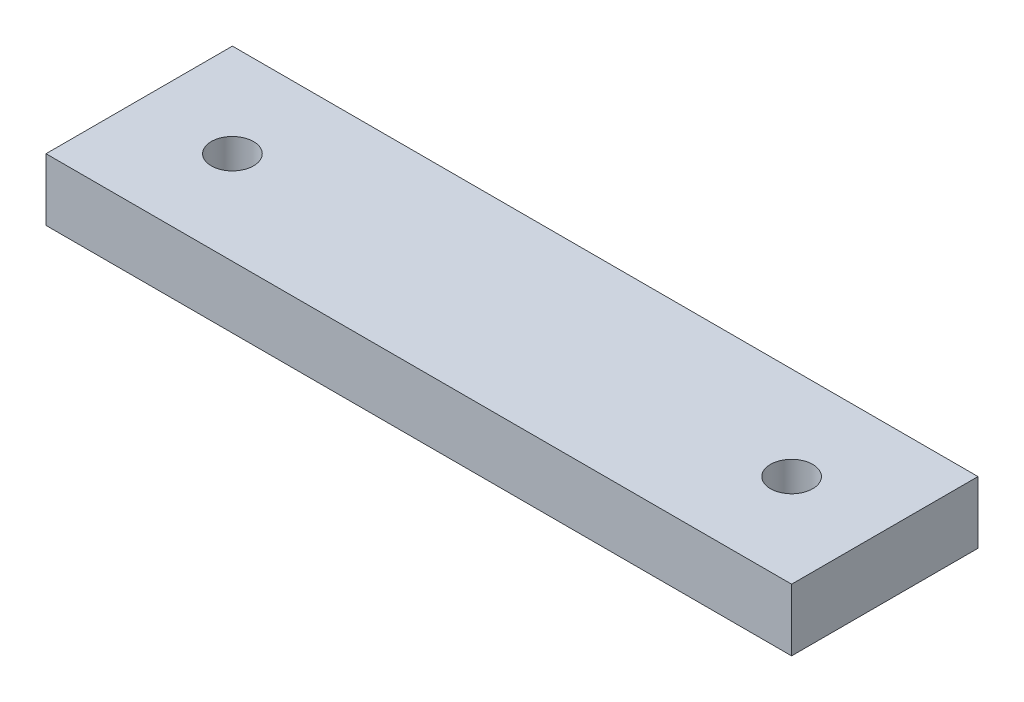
ISO-10303-21;
HEADER;
FILE_DESCRIPTION(('STEP AP214'),'2;1');
FILE_NAME('part.step','',(''),(''),'','','');
FILE_SCHEMA(('AUTOMOTIVE_DESIGN { 1 0 10303 214 1 1 1 1 }'));
ENDSEC;
DATA;
#1=APPLICATION_CONTEXT('core data for automotive mechanical design processes');
#2=APPLICATION_PROTOCOL_DEFINITION('international standard','automotive_design',2000,#1);
#3=PRODUCT_CONTEXT('',#1,'mechanical');
#4=PRODUCT('Part','Part','',(#3));
#5=PRODUCT_RELATED_PRODUCT_CATEGORY('part','',(#4));
#6=PRODUCT_DEFINITION_FORMATION('','',#4);
#7=PRODUCT_DEFINITION_CONTEXT('part definition',#1,'design');
#8=PRODUCT_DEFINITION('design','',#6,#7);
#9=PRODUCT_DEFINITION_SHAPE('','',#8);
#10=(LENGTH_UNIT() NAMED_UNIT(*) SI_UNIT(.MILLI.,.METRE.));
#11=(NAMED_UNIT(*) PLANE_ANGLE_UNIT() SI_UNIT($,.RADIAN.));
#12=(NAMED_UNIT(*) SI_UNIT($,.STERADIAN.) SOLID_ANGLE_UNIT());
#13=UNCERTAINTY_MEASURE_WITH_UNIT(LENGTH_MEASURE(1.E-05),#10,'distance_accuracy_value','');
#14=(GEOMETRIC_REPRESENTATION_CONTEXT(3) GLOBAL_UNCERTAINTY_ASSIGNED_CONTEXT((#13)) GLOBAL_UNIT_ASSIGNED_CONTEXT((#10,
#11,#12)) REPRESENTATION_CONTEXT('',''));
#15=CARTESIAN_POINT('',(0.,0.,0.));
#16=DIRECTION('',(0.,0.,1.));
#17=DIRECTION('',(1.,0.,0.));
#18=AXIS2_PLACEMENT_3D('',#15,#16,#17);
#19=CARTESIAN_POINT('',(-60.,10.,15.));
#20=DIRECTION('',(1.,0.,0.));
#21=DIRECTION('',(0.,0.,-1.));
#22=AXIS2_PLACEMENT_3D('',#19,#20,#21);
#23=PLANE('',#22);
#24=DIRECTION('',(0.,0.,1.));
#25=VECTOR('',#24,1.);
#26=CARTESIAN_POINT('',(-60.,0.,15.));
#27=LINE('',#26,#25);
#28=CARTESIAN_POINT('',(-60.,0.,-15.));
#29=VERTEX_POINT('',#28);
#30=CARTESIAN_POINT('',(-60.,0.,15.));
#31=VERTEX_POINT('',#30);
#32=EDGE_CURVE('E95',#29,#31,#27,.T.);
#33=ORIENTED_EDGE('',*,*,#32,.T.);
#34=DIRECTION('',(0.,-1.,0.));
#35=VECTOR('',#34,1.);
#36=CARTESIAN_POINT('',(-60.,10.,15.));
#37=LINE('',#36,#35);
#38=CARTESIAN_POINT('',(-60.,10.,15.));
#39=VERTEX_POINT('',#38);
#40=EDGE_CURVE('E11',#39,#31,#37,.T.);
#41=ORIENTED_EDGE('',*,*,#40,.F.);
#42=DIRECTION('',(0.,0.,1.));
#43=VECTOR('',#42,1.);
#44=CARTESIAN_POINT('',(-60.,10.,15.));
#45=LINE('',#44,#43);
#46=CARTESIAN_POINT('',(-60.,10.,-15.));
#47=VERTEX_POINT('',#46);
#48=EDGE_CURVE('E83',#47,#39,#45,.T.);
#49=ORIENTED_EDGE('',*,*,#48,.F.);
#50=DIRECTION('',(0.,-1.,0.));
#51=VECTOR('',#50,1.);
#52=CARTESIAN_POINT('',(-60.,10.,-15.));
#53=LINE('',#52,#51);
#54=EDGE_CURVE('E91',#47,#29,#53,.T.);
#55=ORIENTED_EDGE('',*,*,#54,.T.);
#56=EDGE_LOOP('',(#33,#41,#49,#55));
#57=FACE_BOUND('',#56,.T.);
#58=ADVANCED_FACE('F32',(#57),#23,.F.);
#59=CARTESIAN_POINT('',(-60.,10.,15.));
#60=DIRECTION('',(0.,0.,-1.));
#61=DIRECTION('',(-1.,0.,0.));
#62=AXIS2_PLACEMENT_3D('',#59,#60,#61);
#63=PLANE('',#62);
#64=DIRECTION('',(1.,0.,0.));
#65=VECTOR('',#64,1.);
#66=CARTESIAN_POINT('',(-60.,0.,15.));
#67=LINE('',#66,#65);
#68=CARTESIAN_POINT('',(60.,0.,15.));
#69=VERTEX_POINT('',#68);
#70=EDGE_CURVE('E87',#31,#69,#67,.T.);
#71=ORIENTED_EDGE('',*,*,#70,.T.);
#72=DIRECTION('',(0.,-1.,0.));
#73=VECTOR('',#72,1.);
#74=CARTESIAN_POINT('',(60.,10.,15.));
#75=LINE('',#74,#73);
#76=CARTESIAN_POINT('',(60.,10.,15.));
#77=VERTEX_POINT('',#76);
#78=EDGE_CURVE('E40',#77,#69,#75,.T.);
#79=ORIENTED_EDGE('',*,*,#78,.F.);
#80=DIRECTION('',(1.,0.,0.));
#81=VECTOR('',#80,1.);
#82=CARTESIAN_POINT('',(-60.,10.,15.));
#83=LINE('',#82,#81);
#84=EDGE_CURVE('E78',#39,#77,#83,.T.);
#85=ORIENTED_EDGE('',*,*,#84,.F.);
#86=ORIENTED_EDGE('',*,*,#40,.T.);
#87=EDGE_LOOP('',(#71,#79,#85,#86));
#88=FACE_BOUND('',#87,.T.);
#89=ADVANCED_FACE('F86',(#88),#63,.F.);
#90=CARTESIAN_POINT('',(60.,10.,15.));
#91=DIRECTION('',(-1.,0.,0.));
#92=DIRECTION('',(0.,0.,1.));
#93=AXIS2_PLACEMENT_3D('',#90,#91,#92);
#94=PLANE('',#93);
#95=DIRECTION('',(0.,0.,-1.));
#96=VECTOR('',#95,1.);
#97=CARTESIAN_POINT('',(60.,0.,15.));
#98=LINE('',#97,#96);
#99=CARTESIAN_POINT('',(60.,0.,-15.));
#100=VERTEX_POINT('',#99);
#101=EDGE_CURVE('E65',#69,#100,#98,.T.);
#102=ORIENTED_EDGE('',*,*,#101,.T.);
#103=DIRECTION('',(0.,-1.,0.));
#104=VECTOR('',#103,1.);
#105=CARTESIAN_POINT('',(60.,10.,-15.));
#106=LINE('',#105,#104);
#107=CARTESIAN_POINT('',(60.,10.,-15.));
#108=VERTEX_POINT('',#107);
#109=EDGE_CURVE('E88',#108,#100,#106,.T.);
#110=ORIENTED_EDGE('',*,*,#109,.F.);
#111=DIRECTION('',(0.,0.,-1.));
#112=VECTOR('',#111,1.);
#113=CARTESIAN_POINT('',(60.,10.,15.));
#114=LINE('',#113,#112);
#115=EDGE_CURVE('E81',#77,#108,#114,.T.);
#116=ORIENTED_EDGE('',*,*,#115,.F.);
#117=ORIENTED_EDGE('',*,*,#78,.T.);
#118=EDGE_LOOP('',(#102,#110,#116,#117));
#119=FACE_BOUND('',#118,.T.);
#120=ADVANCED_FACE('F89',(#119),#94,.F.);
#121=CARTESIAN_POINT('',(-60.,10.,-15.));
#122=DIRECTION('',(0.,0.,1.));
#123=DIRECTION('',(1.,0.,0.));
#124=AXIS2_PLACEMENT_3D('',#121,#122,#123);
#125=PLANE('',#124);
#126=DIRECTION('',(-1.,0.,0.));
#127=VECTOR('',#126,1.);
#128=CARTESIAN_POINT('',(-60.,0.,-15.));
#129=LINE('',#128,#127);
#130=EDGE_CURVE('E71',#100,#29,#129,.T.);
#131=ORIENTED_EDGE('',*,*,#130,.T.);
#132=ORIENTED_EDGE('',*,*,#54,.F.);
#133=DIRECTION('',(-1.,0.,0.));
#134=VECTOR('',#133,1.);
#135=CARTESIAN_POINT('',(-60.,10.,-15.));
#136=LINE('',#135,#134);
#137=EDGE_CURVE('E48',#108,#47,#136,.T.);
#138=ORIENTED_EDGE('',*,*,#137,.F.);
#139=ORIENTED_EDGE('',*,*,#109,.T.);
#140=EDGE_LOOP('',(#131,#132,#138,#139));
#141=FACE_BOUND('',#140,.T.);
#142=ADVANCED_FACE('F103',(#141),#125,.F.);
#143=CARTESIAN_POINT('',(-60.,10.,-15.));
#144=DIRECTION('',(0.,-1.,0.));
#145=DIRECTION('',(0.,0.,-1.));
#146=AXIS2_PLACEMENT_3D('',#143,#144,#145);
#147=PLANE('',#146);
#148=CARTESIAN_POINT('',(-45.,10.,0.));
#149=DIRECTION('',(0.,1.,0.));
#150=DIRECTION('',(0.,0.,1.));
#151=AXIS2_PLACEMENT_3D('',#148,#149,#150);
#152=CIRCLE('',#151,3.4);
#153=CARTESIAN_POINT('',(-45.,10.,3.4));
#154=VERTEX_POINT('',#153);
#155=EDGE_CURVE('E117',#154,#154,#152,.T.);
#156=ORIENTED_EDGE('',*,*,#155,.F.);
#157=EDGE_LOOP('',(#156));
#158=FACE_BOUND('',#157,.T.);
#159=CARTESIAN_POINT('',(45.,10.,0.));
#160=DIRECTION('',(0.,1.,0.));
#161=DIRECTION('',(0.,0.,1.));
#162=AXIS2_PLACEMENT_3D('',#159,#160,#161);
#163=CIRCLE('',#162,3.4);
#164=CARTESIAN_POINT('',(45.,10.,3.4));
#165=VERTEX_POINT('',#164);
#166=EDGE_CURVE('E111',#165,#165,#163,.T.);
#167=ORIENTED_EDGE('',*,*,#166,.F.);
#168=EDGE_LOOP('',(#167));
#169=FACE_BOUND('',#168,.T.);
#170=ORIENTED_EDGE('',*,*,#48,.T.);
#171=ORIENTED_EDGE('',*,*,#84,.T.);
#172=ORIENTED_EDGE('',*,*,#115,.T.);
#173=ORIENTED_EDGE('',*,*,#137,.T.);
#174=EDGE_LOOP('',(#170,#171,#172,#173));
#175=FACE_BOUND('',#174,.T.);
#176=ADVANCED_FACE('F79',(#158,#169,#175),#147,.F.);
#177=CARTESIAN_POINT('',(-60.,0.,-15.));
#178=DIRECTION('',(0.,-1.,0.));
#179=DIRECTION('',(0.,0.,-1.));
#180=AXIS2_PLACEMENT_3D('',#177,#178,#179);
#181=PLANE('',#180);
#182=CARTESIAN_POINT('',(-45.,0.,0.));
#183=DIRECTION('',(0.,1.,0.));
#184=DIRECTION('',(0.,0.,1.));
#185=AXIS2_PLACEMENT_3D('',#182,#183,#184);
#186=CIRCLE('',#185,3.4);
#187=CARTESIAN_POINT('',(-45.,0.,3.4));
#188=VERTEX_POINT('',#187);
#189=EDGE_CURVE('E114',#188,#188,#186,.T.);
#190=ORIENTED_EDGE('',*,*,#189,.T.);
#191=EDGE_LOOP('',(#190));
#192=FACE_BOUND('',#191,.T.);
#193=CARTESIAN_POINT('',(45.,0.,0.));
#194=DIRECTION('',(0.,1.,0.));
#195=DIRECTION('',(0.,0.,1.));
#196=AXIS2_PLACEMENT_3D('',#193,#194,#195);
#197=CIRCLE('',#196,3.4);
#198=CARTESIAN_POINT('',(45.,0.,3.4));
#199=VERTEX_POINT('',#198);
#200=EDGE_CURVE('E98',#199,#199,#197,.T.);
#201=ORIENTED_EDGE('',*,*,#200,.T.);
#202=EDGE_LOOP('',(#201));
#203=FACE_BOUND('',#202,.T.);
#204=ORIENTED_EDGE('',*,*,#32,.F.);
#205=ORIENTED_EDGE('',*,*,#130,.F.);
#206=ORIENTED_EDGE('',*,*,#101,.F.);
#207=ORIENTED_EDGE('',*,*,#70,.F.);
#208=EDGE_LOOP('',(#204,#205,#206,#207));
#209=FACE_BOUND('',#208,.T.);
#210=ADVANCED_FACE('F106',(#192,#203,#209),#181,.T.);
#211=CARTESIAN_POINT('',(45.,10.,0.));
#212=DIRECTION('',(0.,1.,0.));
#213=DIRECTION('',(0.,0.,1.));
#214=AXIS2_PLACEMENT_3D('',#211,#212,#213);
#215=CYLINDRICAL_SURFACE('',#214,3.4);
#216=ORIENTED_EDGE('',*,*,#200,.F.);
#217=EDGE_LOOP('',(#216));
#218=FACE_BOUND('',#217,.T.);
#219=ORIENTED_EDGE('',*,*,#166,.T.);
#220=EDGE_LOOP('',(#219));
#221=FACE_BOUND('',#220,.T.);
#222=ADVANCED_FACE('F128',(#218,#221),#215,.F.);
#223=CARTESIAN_POINT('',(-45.,10.,0.));
#224=DIRECTION('',(0.,1.,0.));
#225=DIRECTION('',(0.,0.,1.));
#226=AXIS2_PLACEMENT_3D('',#223,#224,#225);
#227=CYLINDRICAL_SURFACE('',#226,3.4);
#228=ORIENTED_EDGE('',*,*,#189,.F.);
#229=EDGE_LOOP('',(#228));
#230=FACE_BOUND('',#229,.T.);
#231=ORIENTED_EDGE('',*,*,#155,.T.);
#232=EDGE_LOOP('',(#231));
#233=FACE_BOUND('',#232,.T.);
#234=ADVANCED_FACE('F121',(#230,#233),#227,.F.);
#235=CLOSED_SHELL('',(#58,#89,#120,#142,#176,#210,#222,#234));
#236=MANIFOLD_SOLID_BREP('B2',#235);
#237=ADVANCED_BREP_SHAPE_REPRESENTATION('',(#18,#236),#14);
#238=SHAPE_DEFINITION_REPRESENTATION(#9,#237);
ENDSEC;
END-ISO-10303-21;
